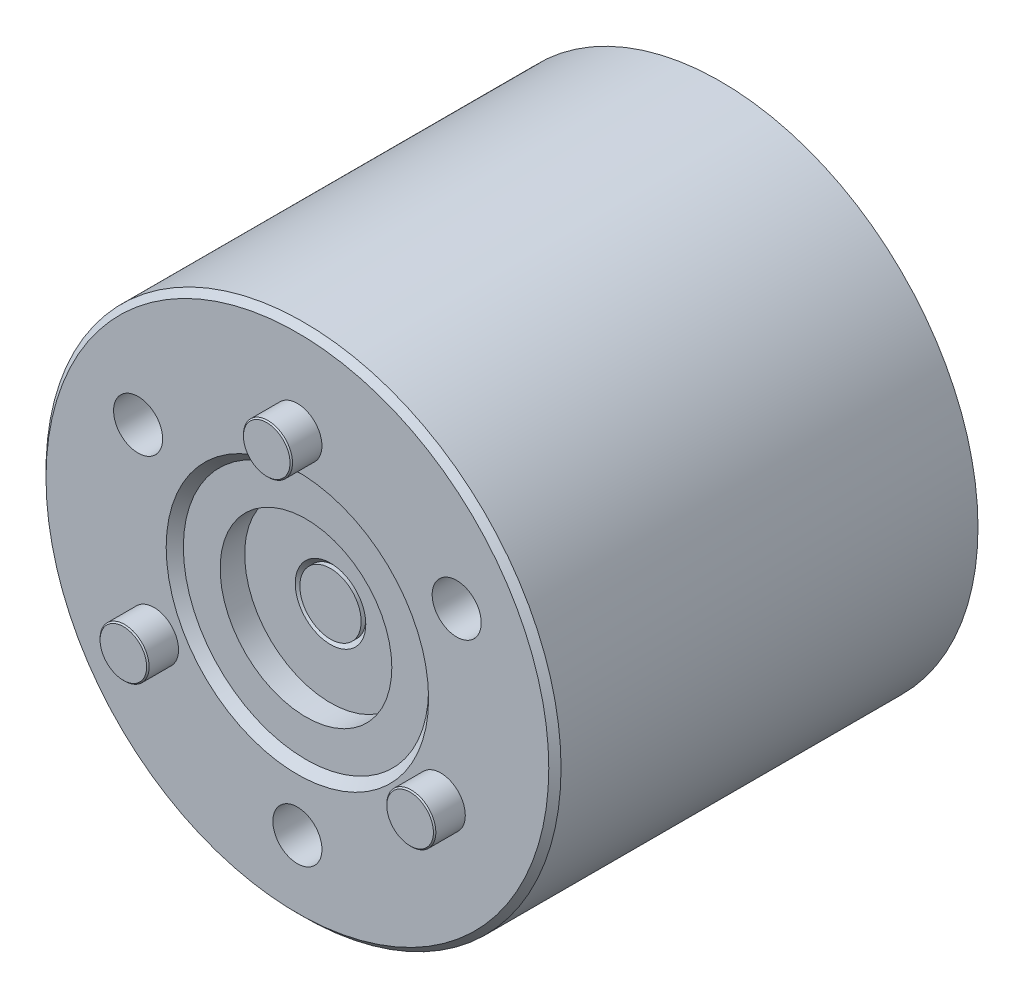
ISO-10303-21;
HEADER;
FILE_DESCRIPTION(('STEP AP214'),'2;1');
FILE_NAME('part.step','',(''),(''),'','','');
FILE_SCHEMA(('AUTOMOTIVE_DESIGN { 1 0 10303 214 1 1 1 1 }'));
ENDSEC;
DATA;
#1=APPLICATION_CONTEXT('core data for automotive mechanical design processes');
#2=APPLICATION_PROTOCOL_DEFINITION('international standard','automotive_design',2000,#1);
#3=PRODUCT_CONTEXT('',#1,'mechanical');
#4=PRODUCT('Part','Part','',(#3));
#5=PRODUCT_RELATED_PRODUCT_CATEGORY('part','',(#4));
#6=PRODUCT_DEFINITION_FORMATION('','',#4);
#7=PRODUCT_DEFINITION_CONTEXT('part definition',#1,'design');
#8=PRODUCT_DEFINITION('design','',#6,#7);
#9=PRODUCT_DEFINITION_SHAPE('','',#8);
#10=(LENGTH_UNIT() NAMED_UNIT(*) SI_UNIT(.MILLI.,.METRE.));
#11=(NAMED_UNIT(*) PLANE_ANGLE_UNIT() SI_UNIT($,.RADIAN.));
#12=(NAMED_UNIT(*) SI_UNIT($,.STERADIAN.) SOLID_ANGLE_UNIT());
#13=UNCERTAINTY_MEASURE_WITH_UNIT(LENGTH_MEASURE(1.E-05),#10,'distance_accuracy_value','');
#14=(GEOMETRIC_REPRESENTATION_CONTEXT(3) GLOBAL_UNCERTAINTY_ASSIGNED_CONTEXT((#13)) GLOBAL_UNIT_ASSIGNED_CONTEXT((#10,
#11,#12)) REPRESENTATION_CONTEXT('',''));
#15=CARTESIAN_POINT('',(0.,0.,0.));
#16=DIRECTION('',(0.,0.,1.));
#17=DIRECTION('',(1.,0.,0.));
#18=AXIS2_PLACEMENT_3D('',#15,#16,#17);
#19=CARTESIAN_POINT('',(0.,0.,-34.5));
#20=DIRECTION('',(0.,0.,1.));
#21=DIRECTION('',(1.,0.,0.));
#22=AXIS2_PLACEMENT_3D('',#19,#20,#21);
#23=CYLINDRICAL_SURFACE('',#22,21.);
#24=CARTESIAN_POINT('',(0.,0.,-0.5));
#25=DIRECTION('',(0.,0.,1.));
#26=DIRECTION('',(1.,0.,0.));
#27=AXIS2_PLACEMENT_3D('',#24,#25,#26);
#28=CIRCLE('',#27,21.);
#29=CARTESIAN_POINT('',(21.,0.,-0.5));
#30=VERTEX_POINT('',#29);
#31=EDGE_CURVE('E114',#30,#30,#28,.F.);
#32=ORIENTED_EDGE('',*,*,#31,.T.);
#33=EDGE_LOOP('',(#32));
#34=FACE_BOUND('',#33,.T.);
#35=CARTESIAN_POINT('',(0.,0.,-34.5));
#36=DIRECTION('',(0.,0.,1.));
#37=DIRECTION('',(1.,0.,0.));
#38=AXIS2_PLACEMENT_3D('',#35,#36,#37);
#39=CIRCLE('',#38,21.);
#40=CARTESIAN_POINT('',(21.,0.,-34.5));
#41=VERTEX_POINT('',#40);
#42=EDGE_CURVE('E94',#41,#41,#39,.T.);
#43=ORIENTED_EDGE('',*,*,#42,.T.);
#44=EDGE_LOOP('',(#43));
#45=FACE_BOUND('',#44,.T.);
#46=ADVANCED_FACE('F44',(#34,#45),#23,.T.);
#47=CARTESIAN_POINT('',(0.,0.,-34.5));
#48=DIRECTION('',(0.,0.,1.));
#49=DIRECTION('',(1.,0.,0.));
#50=AXIS2_PLACEMENT_3D('',#47,#48,#49);
#51=PLANE('',#50);
#52=ORIENTED_EDGE('',*,*,#42,.F.);
#53=EDGE_LOOP('',(#52));
#54=FACE_BOUND('',#53,.T.);
#55=ADVANCED_FACE('F151',(#54),#51,.F.);
#56=CARTESIAN_POINT('',(0.,0.,0.));
#57=DIRECTION('',(0.,0.,1.));
#58=DIRECTION('',(1.,0.,0.));
#59=AXIS2_PLACEMENT_3D('',#56,#57,#58);
#60=PLANE('',#59);
#61=CARTESIAN_POINT('',(0.,0.,0.));
#62=DIRECTION('',(0.,0.,1.));
#63=DIRECTION('',(1.,0.,0.));
#64=AXIS2_PLACEMENT_3D('',#61,#62,#63);
#65=CIRCLE('',#64,10.7);
#66=CARTESIAN_POINT('',(10.7,0.,0.));
#67=VERTEX_POINT('',#66);
#68=EDGE_CURVE('E10',#67,#67,#65,.F.);
#69=ORIENTED_EDGE('',*,*,#68,.T.);
#70=EDGE_LOOP('',(#69));
#71=FACE_BOUND('',#70,.T.);
#72=CARTESIAN_POINT('',(0.,0.,0.));
#73=DIRECTION('',(0.,0.,1.));
#74=DIRECTION('',(1.,0.,0.));
#75=AXIS2_PLACEMENT_3D('',#72,#73,#74);
#76=CIRCLE('',#75,20.5);
#77=CARTESIAN_POINT('',(20.5,0.,0.));
#78=VERTEX_POINT('',#77);
#79=EDGE_CURVE('E111',#78,#78,#76,.T.);
#80=ORIENTED_EDGE('',*,*,#79,.T.);
#81=EDGE_LOOP('',(#80));
#82=FACE_BOUND('',#81,.T.);
#83=CARTESIAN_POINT('',(-11.6913429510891,-6.7500000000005,0.));
#84=DIRECTION('',(0.,0.,1.));
#85=DIRECTION('',(1.,0.,0.));
#86=AXIS2_PLACEMENT_3D('',#83,#84,#85);
#87=CIRCLE('',#86,2.);
#88=CARTESIAN_POINT('',(-9.69134295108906,-6.7500000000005,0.));
#89=VERTEX_POINT('',#88);
#90=EDGE_CURVE('E81',#89,#89,#87,.T.);
#91=ORIENTED_EDGE('',*,*,#90,.F.);
#92=EDGE_LOOP('',(#91));
#93=FACE_BOUND('',#92,.T.);
#94=CARTESIAN_POINT('',(11.6913429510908,-6.74999999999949,0.));
#95=DIRECTION('',(0.,0.,1.));
#96=DIRECTION('',(1.,0.,0.));
#97=AXIS2_PLACEMENT_3D('',#94,#95,#96);
#98=CIRCLE('',#97,2.);
#99=CARTESIAN_POINT('',(13.6913429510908,-6.74999999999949,0.));
#100=VERTEX_POINT('',#99);
#101=EDGE_CURVE('E84',#100,#100,#98,.T.);
#102=ORIENTED_EDGE('',*,*,#101,.F.);
#103=EDGE_LOOP('',(#102));
#104=FACE_BOUND('',#103,.T.);
#105=CARTESIAN_POINT('',(0.,13.5,0.));
#106=DIRECTION('',(0.,0.,1.));
#107=DIRECTION('',(1.,0.,0.));
#108=AXIS2_PLACEMENT_3D('',#105,#106,#107);
#109=CIRCLE('',#108,2.);
#110=CARTESIAN_POINT('',(2.,13.5,0.));
#111=VERTEX_POINT('',#110);
#112=EDGE_CURVE('E87',#111,#111,#109,.T.);
#113=ORIENTED_EDGE('',*,*,#112,.F.);
#114=EDGE_LOOP('',(#113));
#115=FACE_BOUND('',#114,.T.);
#116=CARTESIAN_POINT('',(0.,-15.,0.));
#117=DIRECTION('',(0.,0.,1.));
#118=DIRECTION('',(1.,0.,0.));
#119=AXIS2_PLACEMENT_3D('',#116,#117,#118);
#120=CIRCLE('',#119,2.);
#121=CARTESIAN_POINT('',(2.,-15.,0.));
#122=VERTEX_POINT('',#121);
#123=EDGE_CURVE('E95',#122,#122,#120,.T.);
#124=ORIENTED_EDGE('',*,*,#123,.F.);
#125=EDGE_LOOP('',(#124));
#126=FACE_BOUND('',#125,.T.);
#127=CARTESIAN_POINT('',(-12.9903810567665,7.50000000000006,0.));
#128=DIRECTION('',(0.,0.,1.));
#129=DIRECTION('',(1.,0.,0.));
#130=AXIS2_PLACEMENT_3D('',#127,#128,#129);
#131=CIRCLE('',#130,2.);
#132=CARTESIAN_POINT('',(-10.9903810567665,7.50000000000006,0.));
#133=VERTEX_POINT('',#132);
#134=EDGE_CURVE('E98',#133,#133,#131,.T.);
#135=ORIENTED_EDGE('',*,*,#134,.F.);
#136=EDGE_LOOP('',(#135));
#137=FACE_BOUND('',#136,.T.);
#138=CARTESIAN_POINT('',(12.9903810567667,7.49999999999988,0.));
#139=DIRECTION('',(0.,0.,1.));
#140=DIRECTION('',(1.,0.,0.));
#141=AXIS2_PLACEMENT_3D('',#138,#139,#140);
#142=CIRCLE('',#141,2.);
#143=CARTESIAN_POINT('',(14.9903810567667,7.49999999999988,0.));
#144=VERTEX_POINT('',#143);
#145=EDGE_CURVE('E104',#144,#144,#142,.T.);
#146=ORIENTED_EDGE('',*,*,#145,.F.);
#147=EDGE_LOOP('',(#146));
#148=FACE_BOUND('',#147,.T.);
#149=ADVANCED_FACE('F159',(#71,#82,#93,#104,#115,#126,#137,#148),#60,.T.);
#150=CARTESIAN_POINT('',(12.9903810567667,7.49999999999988,-4.));
#151=DIRECTION('',(0.,0.,1.));
#152=DIRECTION('',(1.,0.,0.));
#153=AXIS2_PLACEMENT_3D('',#150,#151,#152);
#154=CYLINDRICAL_SURFACE('',#153,2.);
#155=CARTESIAN_POINT('',(12.9903810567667,7.49999999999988,-4.));
#156=DIRECTION('',(0.,0.,1.));
#157=DIRECTION('',(1.,0.,0.));
#158=AXIS2_PLACEMENT_3D('',#155,#156,#157);
#159=CIRCLE('',#158,2.);
#160=CARTESIAN_POINT('',(14.9903810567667,7.49999999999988,-4.));
#161=VERTEX_POINT('',#160);
#162=EDGE_CURVE('E90',#161,#161,#159,.T.);
#163=ORIENTED_EDGE('',*,*,#162,.F.);
#164=EDGE_LOOP('',(#163));
#165=FACE_BOUND('',#164,.T.);
#166=ORIENTED_EDGE('',*,*,#145,.T.);
#167=EDGE_LOOP('',(#166));
#168=FACE_BOUND('',#167,.T.);
#169=ADVANCED_FACE('F229',(#165,#168),#154,.F.);
#170=CARTESIAN_POINT('',(12.9903810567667,7.49999999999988,-4.));
#171=DIRECTION('',(0.,0.,1.));
#172=DIRECTION('',(1.,0.,0.));
#173=AXIS2_PLACEMENT_3D('',#170,#171,#172);
#174=PLANE('',#173);
#175=ORIENTED_EDGE('',*,*,#162,.T.);
#176=EDGE_LOOP('',(#175));
#177=FACE_BOUND('',#176,.T.);
#178=ADVANCED_FACE('F224',(#177),#174,.T.);
#179=CARTESIAN_POINT('',(-12.9903810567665,7.50000000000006,-4.));
#180=DIRECTION('',(0.,0.,1.));
#181=DIRECTION('',(1.,0.,0.));
#182=AXIS2_PLACEMENT_3D('',#179,#180,#181);
#183=CYLINDRICAL_SURFACE('',#182,2.);
#184=CARTESIAN_POINT('',(-12.9903810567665,7.50000000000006,-4.));
#185=DIRECTION('',(0.,0.,1.));
#186=DIRECTION('',(1.,0.,0.));
#187=AXIS2_PLACEMENT_3D('',#184,#185,#186);
#188=CIRCLE('',#187,2.);
#189=CARTESIAN_POINT('',(-10.9903810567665,7.50000000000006,-4.));
#190=VERTEX_POINT('',#189);
#191=EDGE_CURVE('E101',#190,#190,#188,.T.);
#192=ORIENTED_EDGE('',*,*,#191,.F.);
#193=EDGE_LOOP('',(#192));
#194=FACE_BOUND('',#193,.T.);
#195=ORIENTED_EDGE('',*,*,#134,.T.);
#196=EDGE_LOOP('',(#195));
#197=FACE_BOUND('',#196,.T.);
#198=ADVANCED_FACE('F221',(#194,#197),#183,.F.);
#199=CARTESIAN_POINT('',(-12.9903810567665,7.50000000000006,-4.));
#200=DIRECTION('',(0.,0.,1.));
#201=DIRECTION('',(1.,0.,0.));
#202=AXIS2_PLACEMENT_3D('',#199,#200,#201);
#203=PLANE('',#202);
#204=ORIENTED_EDGE('',*,*,#191,.T.);
#205=EDGE_LOOP('',(#204));
#206=FACE_BOUND('',#205,.T.);
#207=ADVANCED_FACE('F219',(#206),#203,.T.);
#208=CARTESIAN_POINT('',(0.,-15.,-4.));
#209=DIRECTION('',(0.,0.,1.));
#210=DIRECTION('',(1.,0.,0.));
#211=AXIS2_PLACEMENT_3D('',#208,#209,#210);
#212=CYLINDRICAL_SURFACE('',#211,2.);
#213=CARTESIAN_POINT('',(0.,-15.,-4.));
#214=DIRECTION('',(0.,0.,1.));
#215=DIRECTION('',(1.,0.,0.));
#216=AXIS2_PLACEMENT_3D('',#213,#214,#215);
#217=CIRCLE('',#216,2.);
#218=CARTESIAN_POINT('',(2.,-15.,-4.));
#219=VERTEX_POINT('',#218);
#220=EDGE_CURVE('E91',#219,#219,#217,.T.);
#221=ORIENTED_EDGE('',*,*,#220,.F.);
#222=EDGE_LOOP('',(#221));
#223=FACE_BOUND('',#222,.T.);
#224=ORIENTED_EDGE('',*,*,#123,.T.);
#225=EDGE_LOOP('',(#224));
#226=FACE_BOUND('',#225,.T.);
#227=ADVANCED_FACE('F215',(#223,#226),#212,.F.);
#228=CARTESIAN_POINT('',(0.,-15.,-4.));
#229=DIRECTION('',(0.,0.,1.));
#230=DIRECTION('',(1.,0.,0.));
#231=AXIS2_PLACEMENT_3D('',#228,#229,#230);
#232=PLANE('',#231);
#233=ORIENTED_EDGE('',*,*,#220,.T.);
#234=EDGE_LOOP('',(#233));
#235=FACE_BOUND('',#234,.T.);
#236=ADVANCED_FACE('F212',(#235),#232,.T.);
#237=CARTESIAN_POINT('',(0.,13.5,2.5));
#238=DIRECTION('',(0.,0.,-1.));
#239=DIRECTION('',(-1.,0.,0.));
#240=AXIS2_PLACEMENT_3D('',#237,#238,#239);
#241=CYLINDRICAL_SURFACE('',#240,2.);
#242=CARTESIAN_POINT('',(0.,13.5,2.39999999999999));
#243=DIRECTION('',(0.,0.,1.));
#244=DIRECTION('',(1.,0.,0.));
#245=AXIS2_PLACEMENT_3D('',#242,#243,#244);
#246=CIRCLE('',#245,2.);
#247=CARTESIAN_POINT('',(2.,13.5,2.39999999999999));
#248=VERTEX_POINT('',#247);
#249=EDGE_CURVE('E126',#248,#248,#246,.F.);
#250=ORIENTED_EDGE('',*,*,#249,.T.);
#251=EDGE_LOOP('',(#250));
#252=FACE_BOUND('',#251,.T.);
#253=ORIENTED_EDGE('',*,*,#112,.T.);
#254=EDGE_LOOP('',(#253));
#255=FACE_BOUND('',#254,.T.);
#256=ADVANCED_FACE('F208',(#252,#255),#241,.T.);
#257=CARTESIAN_POINT('',(0.,13.5,2.5));
#258=DIRECTION('',(0.,0.,1.));
#259=DIRECTION('',(1.,0.,0.));
#260=AXIS2_PLACEMENT_3D('',#257,#258,#259);
#261=PLANE('',#260);
#262=CARTESIAN_POINT('',(0.,13.5,2.5));
#263=DIRECTION('',(0.,0.,1.));
#264=DIRECTION('',(1.,0.,0.));
#265=AXIS2_PLACEMENT_3D('',#262,#263,#264);
#266=CIRCLE('',#265,1.89999999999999);
#267=CARTESIAN_POINT('',(1.89999999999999,13.5,2.5));
#268=VERTEX_POINT('',#267);
#269=EDGE_CURVE('E123',#268,#268,#266,.T.);
#270=ORIENTED_EDGE('',*,*,#269,.T.);
#271=EDGE_LOOP('',(#270));
#272=FACE_BOUND('',#271,.T.);
#273=ADVANCED_FACE('F201',(#272),#261,.T.);
#274=CARTESIAN_POINT('',(11.6913429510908,-6.74999999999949,2.5));
#275=DIRECTION('',(0.,0.,-1.));
#276=DIRECTION('',(-1.,0.,0.));
#277=AXIS2_PLACEMENT_3D('',#274,#275,#276);
#278=CYLINDRICAL_SURFACE('',#277,2.);
#279=CARTESIAN_POINT('',(11.6913429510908,-6.74999999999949,2.39999999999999));
#280=DIRECTION('',(0.,0.,1.));
#281=DIRECTION('',(1.,0.,0.));
#282=AXIS2_PLACEMENT_3D('',#279,#280,#281);
#283=CIRCLE('',#282,2.);
#284=CARTESIAN_POINT('',(13.6913429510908,-6.74999999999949,2.39999999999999));
#285=VERTEX_POINT('',#284);
#286=EDGE_CURVE('E120',#285,#285,#283,.F.);
#287=ORIENTED_EDGE('',*,*,#286,.T.);
#288=EDGE_LOOP('',(#287));
#289=FACE_BOUND('',#288,.T.);
#290=ORIENTED_EDGE('',*,*,#101,.T.);
#291=EDGE_LOOP('',(#290));
#292=FACE_BOUND('',#291,.T.);
#293=ADVANCED_FACE('F193',(#289,#292),#278,.T.);
#294=CARTESIAN_POINT('',(11.6913429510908,-6.74999999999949,2.5));
#295=DIRECTION('',(0.,0.,1.));
#296=DIRECTION('',(1.,0.,0.));
#297=AXIS2_PLACEMENT_3D('',#294,#295,#296);
#298=PLANE('',#297);
#299=CARTESIAN_POINT('',(11.6913429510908,-6.74999999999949,2.5));
#300=DIRECTION('',(0.,0.,1.));
#301=DIRECTION('',(1.,0.,0.));
#302=AXIS2_PLACEMENT_3D('',#299,#300,#301);
#303=CIRCLE('',#302,1.89999999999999);
#304=CARTESIAN_POINT('',(13.5913429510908,-6.74999999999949,2.5));
#305=VERTEX_POINT('',#304);
#306=EDGE_CURVE('E117',#305,#305,#303,.T.);
#307=ORIENTED_EDGE('',*,*,#306,.T.);
#308=EDGE_LOOP('',(#307));
#309=FACE_BOUND('',#308,.T.);
#310=ADVANCED_FACE('F190',(#309),#298,.T.);
#311=CARTESIAN_POINT('',(-11.6913429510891,-6.7500000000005,2.5));
#312=DIRECTION('',(0.,0.,-1.));
#313=DIRECTION('',(-1.,0.,0.));
#314=AXIS2_PLACEMENT_3D('',#311,#312,#313);
#315=CYLINDRICAL_SURFACE('',#314,2.);
#316=CARTESIAN_POINT('',(-11.6913429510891,-6.7500000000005,2.39999999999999));
#317=DIRECTION('',(0.,0.,1.));
#318=DIRECTION('',(1.,0.,0.));
#319=AXIS2_PLACEMENT_3D('',#316,#317,#318);
#320=CIRCLE('',#319,2.);
#321=CARTESIAN_POINT('',(-9.69134295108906,-6.7500000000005,2.39999999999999));
#322=VERTEX_POINT('',#321);
#323=EDGE_CURVE('E53',#322,#322,#320,.F.);
#324=ORIENTED_EDGE('',*,*,#323,.T.);
#325=EDGE_LOOP('',(#324));
#326=FACE_BOUND('',#325,.T.);
#327=ORIENTED_EDGE('',*,*,#90,.T.);
#328=EDGE_LOOP('',(#327));
#329=FACE_BOUND('',#328,.T.);
#330=ADVANCED_FACE('F192',(#326,#329),#315,.T.);
#331=CARTESIAN_POINT('',(-11.6913429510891,-6.7500000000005,2.5));
#332=DIRECTION('',(0.,0.,1.));
#333=DIRECTION('',(1.,0.,0.));
#334=AXIS2_PLACEMENT_3D('',#331,#332,#333);
#335=PLANE('',#334);
#336=CARTESIAN_POINT('',(-11.6913429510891,-6.7500000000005,2.5));
#337=DIRECTION('',(0.,0.,1.));
#338=DIRECTION('',(1.,0.,0.));
#339=AXIS2_PLACEMENT_3D('',#336,#337,#338);
#340=CIRCLE('',#339,1.89999999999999);
#341=CARTESIAN_POINT('',(-9.79134295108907,-6.7500000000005,2.5));
#342=VERTEX_POINT('',#341);
#343=EDGE_CURVE('E58',#342,#342,#340,.T.);
#344=ORIENTED_EDGE('',*,*,#343,.T.);
#345=EDGE_LOOP('',(#344));
#346=FACE_BOUND('',#345,.T.);
#347=ADVANCED_FACE('F131',(#346),#335,.T.);
#348=CARTESIAN_POINT('',(0.,0.,0.));
#349=DIRECTION('',(0.,0.,-1.));
#350=DIRECTION('',(-1.,0.,0.));
#351=AXIS2_PLACEMENT_3D('',#348,#349,#350);
#352=CONICAL_SURFACE('',#351,20.5,0.785398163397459);
#353=ORIENTED_EDGE('',*,*,#31,.F.);
#354=EDGE_LOOP('',(#353));
#355=FACE_BOUND('',#354,.T.);
#356=ORIENTED_EDGE('',*,*,#79,.F.);
#357=EDGE_LOOP('',(#356));
#358=FACE_BOUND('',#357,.T.);
#359=ADVANCED_FACE('F166',(#355,#358),#352,.T.);
#360=CARTESIAN_POINT('',(11.6913429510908,-6.74999999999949,2.5));
#361=DIRECTION('',(0.,0.,-1.));
#362=DIRECTION('',(-1.,0.,0.));
#363=AXIS2_PLACEMENT_3D('',#360,#361,#362);
#364=CONICAL_SURFACE('',#363,1.89999999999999,0.785398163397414);
#365=ORIENTED_EDGE('',*,*,#286,.F.);
#366=EDGE_LOOP('',(#365));
#367=FACE_BOUND('',#366,.T.);
#368=ORIENTED_EDGE('',*,*,#306,.F.);
#369=EDGE_LOOP('',(#368));
#370=FACE_BOUND('',#369,.T.);
#371=ADVANCED_FACE('F145',(#367,#370),#364,.T.);
#372=CARTESIAN_POINT('',(0.,13.5,2.5));
#373=DIRECTION('',(0.,0.,-1.));
#374=DIRECTION('',(-1.,0.,0.));
#375=AXIS2_PLACEMENT_3D('',#372,#373,#374);
#376=CONICAL_SURFACE('',#375,1.89999999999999,0.785398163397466);
#377=ORIENTED_EDGE('',*,*,#249,.F.);
#378=EDGE_LOOP('',(#377));
#379=FACE_BOUND('',#378,.T.);
#380=ORIENTED_EDGE('',*,*,#269,.F.);
#381=EDGE_LOOP('',(#380));
#382=FACE_BOUND('',#381,.T.);
#383=ADVANCED_FACE('F136',(#379,#382),#376,.T.);
#384=CARTESIAN_POINT('',(-11.6913429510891,-6.7500000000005,2.5));
#385=DIRECTION('',(0.,0.,-1.));
#386=DIRECTION('',(-1.,0.,0.));
#387=AXIS2_PLACEMENT_3D('',#384,#385,#386);
#388=CONICAL_SURFACE('',#387,1.89999999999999,0.785398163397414);
#389=ORIENTED_EDGE('',*,*,#323,.F.);
#390=EDGE_LOOP('',(#389));
#391=FACE_BOUND('',#390,.T.);
#392=ORIENTED_EDGE('',*,*,#343,.F.);
#393=EDGE_LOOP('',(#392));
#394=FACE_BOUND('',#393,.T.);
#395=ADVANCED_FACE('F133',(#391,#394),#388,.T.);
#396=CARTESIAN_POINT('',(0.,0.,-0.7));
#397=DIRECTION('',(0.,0.,1.));
#398=DIRECTION('',(1.,0.,0.));
#399=AXIS2_PLACEMENT_3D('',#396,#397,#398);
#400=PLANE('',#399);
#401=CARTESIAN_POINT('',(0.,0.,-0.7));
#402=DIRECTION('',(0.,0.,1.));
#403=DIRECTION('',(1.,0.,0.));
#404=AXIS2_PLACEMENT_3D('',#401,#402,#403);
#405=CIRCLE('',#404,7.);
#406=CARTESIAN_POINT('',(7.,0.,-0.7));
#407=VERTEX_POINT('',#406);
#408=EDGE_CURVE('E67',#407,#407,#405,.T.);
#409=ORIENTED_EDGE('',*,*,#408,.F.);
#410=EDGE_LOOP('',(#409));
#411=FACE_BOUND('',#410,.T.);
#412=CARTESIAN_POINT('',(0.,0.,-0.7));
#413=DIRECTION('',(0.,0.,1.));
#414=DIRECTION('',(1.,0.,0.));
#415=AXIS2_PLACEMENT_3D('',#412,#413,#414);
#416=CIRCLE('',#415,10.);
#417=CARTESIAN_POINT('',(10.,0.,-0.7));
#418=VERTEX_POINT('',#417);
#419=EDGE_CURVE('E76',#418,#418,#416,.T.);
#420=ORIENTED_EDGE('',*,*,#419,.T.);
#421=EDGE_LOOP('',(#420));
#422=FACE_BOUND('',#421,.T.);
#423=ADVANCED_FACE('F135',(#411,#422),#400,.T.);
#424=CARTESIAN_POINT('',(0.,0.,-0.700000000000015));
#425=DIRECTION('',(0.,0.,1.));
#426=DIRECTION('',(1.,0.,0.));
#427=AXIS2_PLACEMENT_3D('',#424,#425,#426);
#428=CONICAL_SURFACE('',#427,10.,0.785398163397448);
#429=ORIENTED_EDGE('',*,*,#68,.F.);
#430=EDGE_LOOP('',(#429));
#431=FACE_BOUND('',#430,.T.);
#432=ORIENTED_EDGE('',*,*,#419,.F.);
#433=EDGE_LOOP('',(#432));
#434=FACE_BOUND('',#433,.T.);
#435=ADVANCED_FACE('F47',(#431,#434),#428,.F.);
#436=CARTESIAN_POINT('',(0.,0.,-2.7));
#437=DIRECTION('',(0.,0.,1.));
#438=DIRECTION('',(1.,0.,0.));
#439=AXIS2_PLACEMENT_3D('',#436,#437,#438);
#440=CYLINDRICAL_SURFACE('',#439,7.);
#441=CARTESIAN_POINT('',(0.,0.,-2.7));
#442=DIRECTION('',(0.,0.,1.));
#443=DIRECTION('',(1.,0.,0.));
#444=AXIS2_PLACEMENT_3D('',#441,#442,#443);
#445=CIRCLE('',#444,7.);
#446=CARTESIAN_POINT('',(7.,0.,-2.7));
#447=VERTEX_POINT('',#446);
#448=EDGE_CURVE('E73',#447,#447,#445,.T.);
#449=ORIENTED_EDGE('',*,*,#448,.F.);
#450=EDGE_LOOP('',(#449));
#451=FACE_BOUND('',#450,.T.);
#452=ORIENTED_EDGE('',*,*,#408,.T.);
#453=EDGE_LOOP('',(#452));
#454=FACE_BOUND('',#453,.T.);
#455=ADVANCED_FACE('F269',(#451,#454),#440,.F.);
#456=CARTESIAN_POINT('',(0.,0.,-2.7));
#457=DIRECTION('',(0.,0.,1.));
#458=DIRECTION('',(1.,0.,0.));
#459=AXIS2_PLACEMENT_3D('',#456,#457,#458);
#460=PLANE('',#459);
#461=CARTESIAN_POINT('',(0.,0.,-2.7));
#462=DIRECTION('',(0.,0.,1.));
#463=DIRECTION('',(1.,0.,0.));
#464=AXIS2_PLACEMENT_3D('',#461,#462,#463);
#465=CIRCLE('',#464,2.87717755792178);
#466=CARTESIAN_POINT('',(2.87717755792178,0.,-2.7));
#467=VERTEX_POINT('',#466);
#468=EDGE_CURVE('E61',#467,#467,#465,.T.);
#469=ORIENTED_EDGE('',*,*,#468,.F.);
#470=EDGE_LOOP('',(#469));
#471=FACE_BOUND('',#470,.T.);
#472=ORIENTED_EDGE('',*,*,#448,.T.);
#473=EDGE_LOOP('',(#472));
#474=FACE_BOUND('',#473,.T.);
#475=ADVANCED_FACE('F283',(#471,#474),#460,.T.);
#476=CARTESIAN_POINT('',(0.,0.,-34.5));
#477=DIRECTION('',(0.,0.,-1.));
#478=DIRECTION('',(-1.,0.,0.));
#479=AXIS2_PLACEMENT_3D('',#476,#477,#478);
#480=CYLINDRICAL_SURFACE('',#479,2.49999999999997);
#481=CARTESIAN_POINT('',(0.,0.,-2.7));
#482=DIRECTION('',(0.,0.,1.));
#483=DIRECTION('',(1.,0.,0.));
#484=AXIS2_PLACEMENT_3D('',#481,#482,#483);
#485=CIRCLE('',#484,2.49999999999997);
#486=CARTESIAN_POINT('',(2.49999999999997,0.,-2.7));
#487=VERTEX_POINT('',#486);
#488=EDGE_CURVE('E49',#487,#487,#485,.F.);
#489=ORIENTED_EDGE('',*,*,#488,.T.);
#490=EDGE_LOOP('',(#489));
#491=FACE_BOUND('',#490,.T.);
#492=CARTESIAN_POINT('',(0.,0.,-3.07717755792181));
#493=DIRECTION('',(0.,0.,-1.));
#494=DIRECTION('',(-1.,0.,0.));
#495=AXIS2_PLACEMENT_3D('',#492,#493,#494);
#496=CIRCLE('',#495,2.49999999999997);
#497=CARTESIAN_POINT('',(-2.49999999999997,0.,-3.07717755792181));
#498=VERTEX_POINT('',#497);
#499=EDGE_CURVE('E63',#498,#498,#496,.T.);
#500=ORIENTED_EDGE('',*,*,#499,.F.);
#501=EDGE_LOOP('',(#500));
#502=FACE_BOUND('',#501,.T.);
#503=ADVANCED_FACE('F292',(#491,#502),#480,.T.);
#504=CARTESIAN_POINT('',(0.,0.,-3.07717755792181));
#505=DIRECTION('',(0.,0.,1.));
#506=DIRECTION('',(1.,0.,0.));
#507=AXIS2_PLACEMENT_3D('',#504,#505,#506);
#508=CONICAL_SURFACE('',#507,2.49999999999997,0.785398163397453);
#509=ORIENTED_EDGE('',*,*,#468,.T.);
#510=EDGE_LOOP('',(#509));
#511=FACE_BOUND('',#510,.T.);
#512=ORIENTED_EDGE('',*,*,#499,.T.);
#513=EDGE_LOOP('',(#512));
#514=FACE_BOUND('',#513,.T.);
#515=ADVANCED_FACE('F303',(#511,#514),#508,.F.);
#516=ORIENTED_EDGE('',*,*,#488,.F.);
#517=EDGE_LOOP('',(#516));
#518=FACE_BOUND('',#517,.T.);
#519=ADVANCED_FACE('F295',(#518),#460,.T.);
#520=CLOSED_SHELL('',(#46,#55,#149,#169,#178,#198,#207,#227,#236,#256,#273,#293,#310,#330,#347,
#359,#371,#383,#395,#423,#435,#455,#475,#503,#515,#519));
#521=MANIFOLD_SOLID_BREP('B2',#520);
#522=ADVANCED_BREP_SHAPE_REPRESENTATION('',(#18,#521),#14);
#523=SHAPE_DEFINITION_REPRESENTATION(#9,#522);
ENDSEC;
END-ISO-10303-21;
